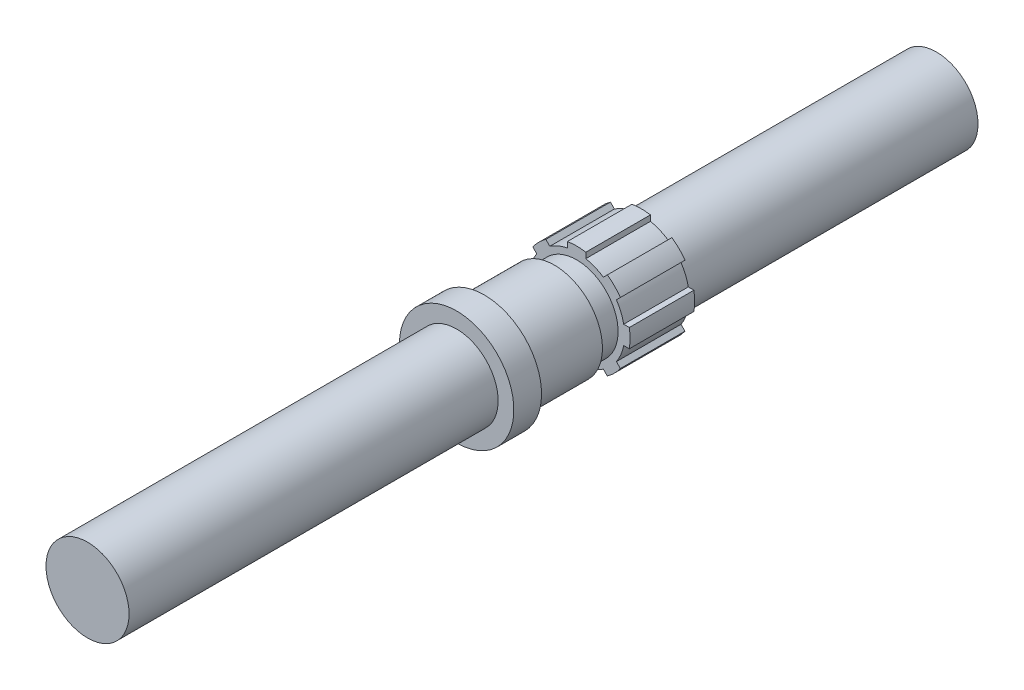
from build123d import *

# Parameters (mm, degrees)
SKIZZE1_R                       = 22.5
BASIS_LINEAR_AUSTRAGEN_DEPTH    = 460
SKIZZE2_R                       = 26
AUFSATZ_LINEAR_AUSTRAGEN1_DEPTH = 85
LINEAR_AUSTRAGEN1_DEPTH         = 35
KREISMUSTER1_COUNT              = 8
SKIZZE3_R                       = 31
AUFSATZ_LINEAR_AUSTRAGEN2_DEPTH = 15
SKIZZE5_W                       = 12
SKIZZE5_H                       = 3.5


with BuildPart() as part:
    # Skizze1 → Basis-Linear austragen (new body)
    with BuildSketch(Plane.XY):
        Circle(SKIZZE1_R)
    extrude(amount=BASIS_LINEAR_AUSTRAGEN_DEPTH)

    # Skizze2 → Aufsatz-Linear austragen1 (add)
    with BuildSketch(Plane(origin=(0, 0, 160), x_dir=(-1, 0, 0), z_dir=(0, 0, -1))):
        Circle(SKIZZE2_R)
    extrude(amount=-AUFSATZ_LINEAR_AUSTRAGEN1_DEPTH)

    # Skizze4 → Linear austragen1 (add)
    with BuildSketch(Plane(origin=(0, 0, 160), x_dir=(-1, 0, 0), z_dir=(0, 0, -1))):
        with BuildLine():
            Line((-5, 25.514701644), (-5, 28.565713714))
            ThreePointArc((-5, 28.565713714), (0, 29), (5, 28.565713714))
            Line((5, 28.565713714), (5, 25.514701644))
            ThreePointArc((5, 25.514701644), (0, 26), (-5, 25.514701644))
        make_face()
    linear_austragen1 = extrude(amount=-LINEAR_AUSTRAGEN1_DEPTH)

    # Kreismuster1: Linear austragen1 ×8 about axis
    kreismuster1_axis = Axis((0, 0, 0), (0, 0, 1))
    for i in range(1, KREISMUSTER1_COUNT):
        add(linear_austragen1.rotate(kreismuster1_axis, i * 360 / KREISMUSTER1_COUNT))

    # Skizze3 → Aufsatz-Linear austragen2 (add)
    with BuildSketch(Plane(origin=(0, 0, 245), x_dir=(-1, 0, 0), z_dir=(0, 0, -1))):
        Circle(SKIZZE3_R)
    extrude(amount=-AUFSATZ_LINEAR_AUSTRAGEN2_DEPTH)

    # Skizze5 → Schnitt-Rotation1 (revolve, cut)
    with BuildSketch(Plane(origin=(0, 0, 0), x_dir=(0, 0, -1), z_dir=(1, 0, 0)), mode=Mode.PRIVATE) as schnitt_rotation1_sk:
        with Locations((-201, 24.25)):
            Rectangle(SKIZZE5_W, SKIZZE5_H)
    revolve(schnitt_rotation1_sk.sketch.rotate(Axis((0, 0, 0), (0, 0, 1)), 90), axis=Axis((0, 0, 0), (0, 0, 1)), mode=Mode.SUBTRACT)


solid = part.part
